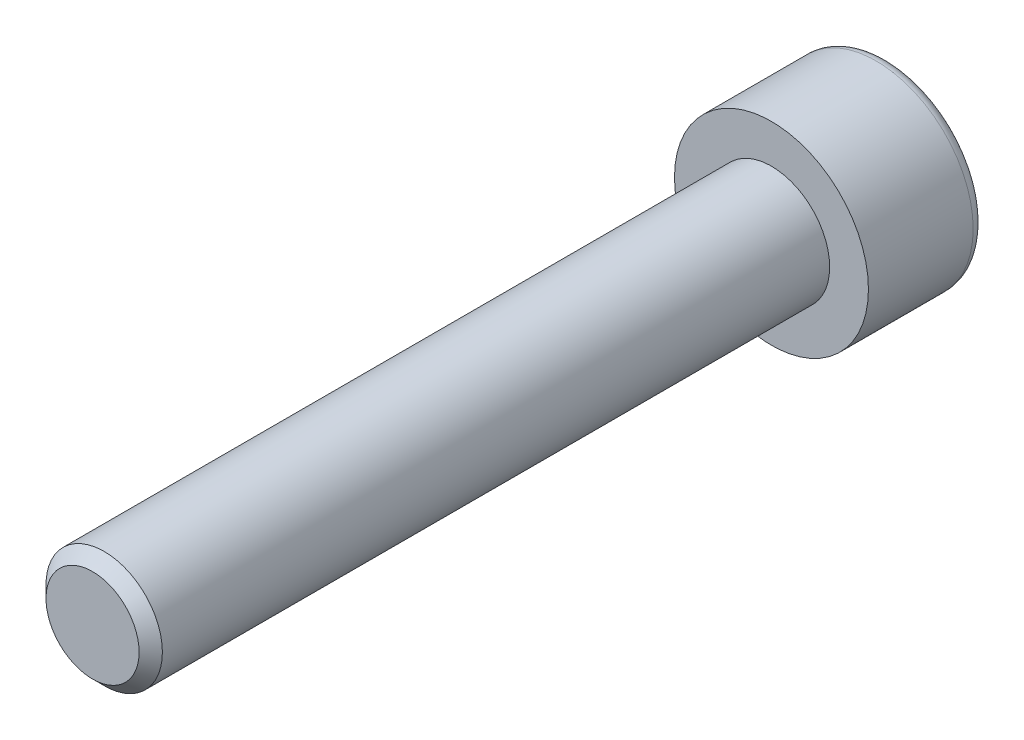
from build123d import *

# Parameters (mm, degrees)
ENLEV_MAT_EXTRU1_DEPTH = 3
ESQUISSE3_W            = 3
ESQUISSE3_H            = 35
CHANFREIN1_SIZE        = 0.6


with BuildPart() as part:
    # Esquisse1 → Base-R_volution (revolve)
    with BuildSketch(Plane(origin=(0, 0, 0), x_dir=(1, 0, 0), z_dir=(0, 1, 0)), mode=Mode.PRIVATE) as base_r_volution_sk:
        with BuildLine():
            Line((0, 0), (5, 0))
            Line((5, 0), (5, 5.4))
            ThreePointArc((5, 5.4), (4.824264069, 5.824264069), (4.4, 6))
            Line((4.4, 6), (0, 6))
            Line((0, 6), (0, 0))
        make_face()
    revolve(base_r_volution_sk.sketch.rotate(Axis((0, 0, 0), (0, 0, -1)), 180), axis=Axis((0, 0, 0), (0, 0, -1)))

    # Esquisse2 → enlev-mat-Extru1 (cut)
    with BuildSketch(Plane.XY.offset(-6)):
        Polygon((2.5, -1.443375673), (2.5, 1.443375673), (0, 2.886751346), (-2.5, 1.443375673), (-2.5, -1.443375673), (0, -2.886751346), align=None)
    extrude(amount=ENLEV_MAT_EXTRU1_DEPTH, mode=Mode.SUBTRACT)

    # Esquisse3 → Boss.-R_vol.1 (revolve)
    with BuildSketch(Plane(origin=(0, 0, 0), x_dir=(1, 0, 0), z_dir=(0, 1, 0))):
        with Locations((1.5, -17.5)):
            Rectangle(ESQUISSE3_W, ESQUISSE3_H)
    revolve(axis=Axis((0, 0, 0), (0, 0, 1)))

    # Chanfrein1
    chanfrein1_edges = [part.edges().sort_by_distance(p)[0] for p in [
        (-3, 0, 35),
    ]]
    chamfer(chanfrein1_edges, length=CHANFREIN1_SIZE)


solid = part.part
